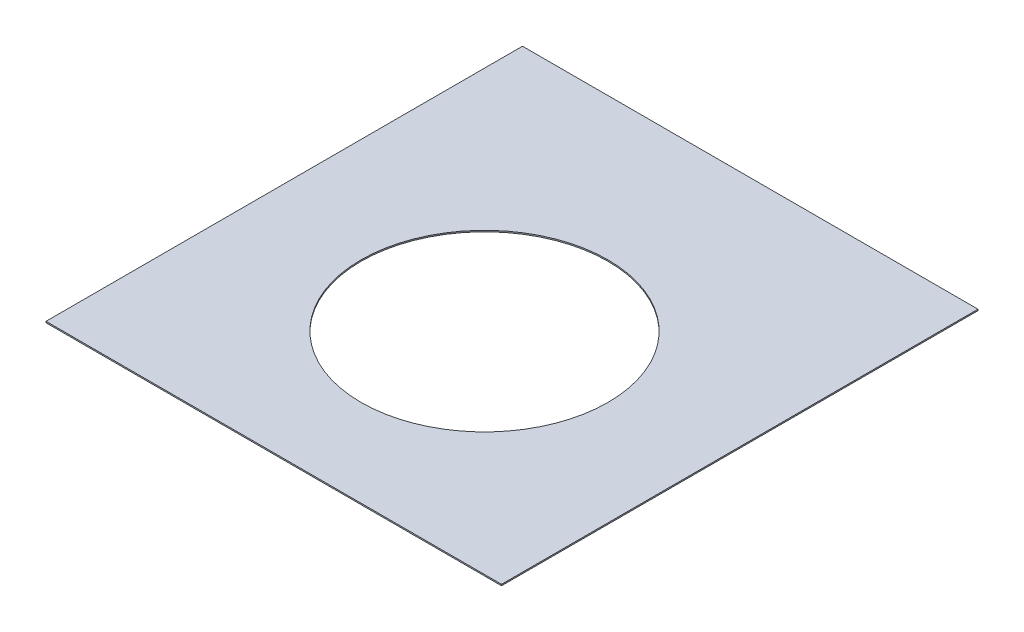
ISO-10303-21;
HEADER;
FILE_DESCRIPTION(('STEP AP214'),'2;1');
FILE_NAME('part.step','',(''),(''),'','','');
FILE_SCHEMA(('AUTOMOTIVE_DESIGN { 1 0 10303 214 1 1 1 1 }'));
ENDSEC;
DATA;
#1=APPLICATION_CONTEXT('core data for automotive mechanical design processes');
#2=APPLICATION_PROTOCOL_DEFINITION('international standard','automotive_design',2000,#1);
#3=PRODUCT_CONTEXT('',#1,'mechanical');
#4=PRODUCT('Part','Part','',(#3));
#5=PRODUCT_RELATED_PRODUCT_CATEGORY('part','',(#4));
#6=PRODUCT_DEFINITION_FORMATION('','',#4);
#7=PRODUCT_DEFINITION_CONTEXT('part definition',#1,'design');
#8=PRODUCT_DEFINITION('design','',#6,#7);
#9=PRODUCT_DEFINITION_SHAPE('','',#8);
#10=(LENGTH_UNIT() NAMED_UNIT(*) SI_UNIT(.MILLI.,.METRE.));
#11=(NAMED_UNIT(*) PLANE_ANGLE_UNIT() SI_UNIT($,.RADIAN.));
#12=(NAMED_UNIT(*) SI_UNIT($,.STERADIAN.) SOLID_ANGLE_UNIT());
#13=UNCERTAINTY_MEASURE_WITH_UNIT(LENGTH_MEASURE(1.E-05),#10,'distance_accuracy_value','');
#14=(GEOMETRIC_REPRESENTATION_CONTEXT(3) GLOBAL_UNCERTAINTY_ASSIGNED_CONTEXT((#13)) GLOBAL_UNIT_ASSIGNED_CONTEXT((#10,
#11,#12)) REPRESENTATION_CONTEXT('',''));
#15=CARTESIAN_POINT('',(0.,0.,0.));
#16=DIRECTION('',(0.,0.,1.));
#17=DIRECTION('',(1.,0.,0.));
#18=AXIS2_PLACEMENT_3D('',#15,#16,#17);
#19=CARTESIAN_POINT('',(828.675,-4.7625,-866.775));
#20=DIRECTION('',(1.,0.,0.));
#21=DIRECTION('',(0.,0.,-1.));
#22=AXIS2_PLACEMENT_3D('',#19,#20,#21);
#23=PLANE('',#22);
#24=DIRECTION('',(0.,0.,-1.));
#25=VECTOR('',#24,1.);
#26=CARTESIAN_POINT('',(828.675,0.,-866.775));
#27=LINE('',#26,#25);
#28=CARTESIAN_POINT('',(828.675,0.,866.775));
#29=VERTEX_POINT('',#28);
#30=CARTESIAN_POINT('',(828.675,0.,-866.775));
#31=VERTEX_POINT('',#30);
#32=EDGE_CURVE('E101',#29,#31,#27,.T.);
#33=ORIENTED_EDGE('',*,*,#32,.F.);
#34=DIRECTION('',(0.,1.,0.));
#35=VECTOR('',#34,1.);
#36=CARTESIAN_POINT('',(828.675,-4.7625,866.775));
#37=LINE('',#36,#35);
#38=CARTESIAN_POINT('',(828.675,-4.7625,866.775));
#39=VERTEX_POINT('',#38);
#40=EDGE_CURVE('E11',#39,#29,#37,.T.);
#41=ORIENTED_EDGE('',*,*,#40,.F.);
#42=DIRECTION('',(0.,0.,-1.));
#43=VECTOR('',#42,1.);
#44=CARTESIAN_POINT('',(828.675,-4.7625,-866.775));
#45=LINE('',#44,#43);
#46=CARTESIAN_POINT('',(828.675,-4.7625,-866.775));
#47=VERTEX_POINT('',#46);
#48=EDGE_CURVE('E94',#39,#47,#45,.T.);
#49=ORIENTED_EDGE('',*,*,#48,.T.);
#50=DIRECTION('',(0.,1.,0.));
#51=VECTOR('',#50,1.);
#52=CARTESIAN_POINT('',(828.675,-4.7625,-866.775));
#53=LINE('',#52,#51);
#54=EDGE_CURVE('E39',#47,#31,#53,.T.);
#55=ORIENTED_EDGE('',*,*,#54,.T.);
#56=EDGE_LOOP('',(#33,#41,#49,#55));
#57=FACE_BOUND('',#56,.T.);
#58=ADVANCED_FACE('F36',(#57),#23,.T.);
#59=CARTESIAN_POINT('',(-828.675,-4.7625,866.775));
#60=DIRECTION('',(0.,0.,1.));
#61=DIRECTION('',(1.,0.,0.));
#62=AXIS2_PLACEMENT_3D('',#59,#60,#61);
#63=PLANE('',#62);
#64=DIRECTION('',(1.,0.,0.));
#65=VECTOR('',#64,1.);
#66=CARTESIAN_POINT('',(-828.675,0.,866.775));
#67=LINE('',#66,#65);
#68=CARTESIAN_POINT('',(-828.675,0.,866.775));
#69=VERTEX_POINT('',#68);
#70=EDGE_CURVE('E96',#69,#29,#67,.T.);
#71=ORIENTED_EDGE('',*,*,#70,.F.);
#72=DIRECTION('',(0.,1.,0.));
#73=VECTOR('',#72,1.);
#74=CARTESIAN_POINT('',(-828.675,-4.7625,866.775));
#75=LINE('',#74,#73);
#76=CARTESIAN_POINT('',(-828.675,-4.7625,866.775));
#77=VERTEX_POINT('',#76);
#78=EDGE_CURVE('E45',#77,#69,#75,.T.);
#79=ORIENTED_EDGE('',*,*,#78,.F.);
#80=DIRECTION('',(1.,0.,0.));
#81=VECTOR('',#80,1.);
#82=CARTESIAN_POINT('',(-828.675,-4.7625,866.775));
#83=LINE('',#82,#81);
#84=EDGE_CURVE('E91',#77,#39,#83,.T.);
#85=ORIENTED_EDGE('',*,*,#84,.T.);
#86=ORIENTED_EDGE('',*,*,#40,.T.);
#87=EDGE_LOOP('',(#71,#79,#85,#86));
#88=FACE_BOUND('',#87,.T.);
#89=ADVANCED_FACE('F112',(#88),#63,.T.);
#90=CARTESIAN_POINT('',(-828.675,-4.7625,-866.775));
#91=DIRECTION('',(-1.,0.,0.));
#92=DIRECTION('',(0.,0.,1.));
#93=AXIS2_PLACEMENT_3D('',#90,#91,#92);
#94=PLANE('',#93);
#95=DIRECTION('',(0.,0.,1.));
#96=VECTOR('',#95,1.);
#97=CARTESIAN_POINT('',(-828.675,0.,-866.775));
#98=LINE('',#97,#96);
#99=CARTESIAN_POINT('',(-828.675,0.,-866.775));
#100=VERTEX_POINT('',#99);
#101=EDGE_CURVE('E86',#100,#69,#98,.T.);
#102=ORIENTED_EDGE('',*,*,#101,.F.);
#103=DIRECTION('',(0.,1.,0.));
#104=VECTOR('',#103,1.);
#105=CARTESIAN_POINT('',(-828.675,-4.7625,-866.775));
#106=LINE('',#105,#104);
#107=CARTESIAN_POINT('',(-828.675,-4.7625,-866.775));
#108=VERTEX_POINT('',#107);
#109=EDGE_CURVE('E81',#108,#100,#106,.T.);
#110=ORIENTED_EDGE('',*,*,#109,.F.);
#111=DIRECTION('',(0.,0.,1.));
#112=VECTOR('',#111,1.);
#113=CARTESIAN_POINT('',(-828.675,-4.7625,-866.775));
#114=LINE('',#113,#112);
#115=EDGE_CURVE('E84',#108,#77,#114,.T.);
#116=ORIENTED_EDGE('',*,*,#115,.T.);
#117=ORIENTED_EDGE('',*,*,#78,.T.);
#118=EDGE_LOOP('',(#102,#110,#116,#117));
#119=FACE_BOUND('',#118,.T.);
#120=ADVANCED_FACE('F83',(#119),#94,.T.);
#121=CARTESIAN_POINT('',(-828.675,-4.7625,-866.775));
#122=DIRECTION('',(0.,0.,-1.));
#123=DIRECTION('',(-1.,0.,0.));
#124=AXIS2_PLACEMENT_3D('',#121,#122,#123);
#125=PLANE('',#124);
#126=DIRECTION('',(-1.,0.,0.));
#127=VECTOR('',#126,1.);
#128=CARTESIAN_POINT('',(-828.675,0.,-866.775));
#129=LINE('',#128,#127);
#130=EDGE_CURVE('E104',#31,#100,#129,.T.);
#131=ORIENTED_EDGE('',*,*,#130,.F.);
#132=ORIENTED_EDGE('',*,*,#54,.F.);
#133=DIRECTION('',(-1.,0.,0.));
#134=VECTOR('',#133,1.);
#135=CARTESIAN_POINT('',(-828.675,-4.7625,-866.775));
#136=LINE('',#135,#134);
#137=EDGE_CURVE('E90',#47,#108,#136,.T.);
#138=ORIENTED_EDGE('',*,*,#137,.T.);
#139=ORIENTED_EDGE('',*,*,#109,.T.);
#140=EDGE_LOOP('',(#131,#132,#138,#139));
#141=FACE_BOUND('',#140,.T.);
#142=ADVANCED_FACE('F93',(#141),#125,.T.);
#143=CARTESIAN_POINT('',(828.675,-4.7625,866.775));
#144=DIRECTION('',(0.,1.,0.));
#145=DIRECTION('',(0.,0.,1.));
#146=AXIS2_PLACEMENT_3D('',#143,#144,#145);
#147=PLANE('',#146);
#148=CARTESIAN_POINT('',(-1.11022302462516E-13,-4.7625,100.0125));
#149=DIRECTION('',(0.,1.,0.));
#150=DIRECTION('',(0.,0.,1.));
#151=AXIS2_PLACEMENT_3D('',#148,#149,#150);
#152=CIRCLE('',#151,449.2625);
#153=CARTESIAN_POINT('',(-1.11022302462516E-13,-4.7625,549.275));
#154=VERTEX_POINT('',#153);
#155=EDGE_CURVE('E105',#154,#154,#152,.T.);
#156=ORIENTED_EDGE('',*,*,#155,.T.);
#157=EDGE_LOOP('',(#156));
#158=FACE_BOUND('',#157,.T.);
#159=ORIENTED_EDGE('',*,*,#48,.F.);
#160=ORIENTED_EDGE('',*,*,#84,.F.);
#161=ORIENTED_EDGE('',*,*,#115,.F.);
#162=ORIENTED_EDGE('',*,*,#137,.F.);
#163=EDGE_LOOP('',(#159,#160,#161,#162));
#164=FACE_BOUND('',#163,.T.);
#165=ADVANCED_FACE('F89',(#158,#164),#147,.F.);
#166=CARTESIAN_POINT('',(828.675,0.,866.775));
#167=DIRECTION('',(0.,1.,0.));
#168=DIRECTION('',(0.,0.,1.));
#169=AXIS2_PLACEMENT_3D('',#166,#167,#168);
#170=PLANE('',#169);
#171=CARTESIAN_POINT('',(-1.11022302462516E-13,0.,100.0125));
#172=DIRECTION('',(0.,1.,0.));
#173=DIRECTION('',(0.,0.,1.));
#174=AXIS2_PLACEMENT_3D('',#171,#172,#173);
#175=CIRCLE('',#174,449.2625);
#176=CARTESIAN_POINT('',(-1.11022302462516E-13,0.,549.275));
#177=VERTEX_POINT('',#176);
#178=EDGE_CURVE('E142',#177,#177,#175,.T.);
#179=ORIENTED_EDGE('',*,*,#178,.F.);
#180=EDGE_LOOP('',(#179));
#181=FACE_BOUND('',#180,.T.);
#182=ORIENTED_EDGE('',*,*,#32,.T.);
#183=ORIENTED_EDGE('',*,*,#130,.T.);
#184=ORIENTED_EDGE('',*,*,#101,.T.);
#185=ORIENTED_EDGE('',*,*,#70,.T.);
#186=EDGE_LOOP('',(#182,#183,#184,#185));
#187=FACE_BOUND('',#186,.T.);
#188=ADVANCED_FACE('F111',(#181,#187),#170,.T.);
#189=CARTESIAN_POINT('',(-1.11022302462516E-13,-4.7625,100.0125));
#190=DIRECTION('',(0.,1.,0.));
#191=DIRECTION('',(0.,0.,1.));
#192=AXIS2_PLACEMENT_3D('',#189,#190,#191);
#193=CYLINDRICAL_SURFACE('',#192,449.2625);
#194=CARTESIAN_POINT('',(-1.11022302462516E-13,-4.7625,549.275));
#195=CARTESIAN_POINT('',(-1.11022302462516E-13,-4.712890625,549.275));
#196=CARTESIAN_POINT('',(-1.11022302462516E-13,-4.66328125,549.275));
#197=CARTESIAN_POINT('',(-1.11022302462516E-13,-4.5640625,549.275));
#198=CARTESIAN_POINT('',(-1.11022302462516E-13,-4.514453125,549.275));
#199=CARTESIAN_POINT('',(-1.11022302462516E-13,-4.415234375,549.275));
#200=CARTESIAN_POINT('',(-1.11022302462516E-13,-4.365625,549.275));
#201=CARTESIAN_POINT('',(-1.11022302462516E-13,-4.26640625,549.275));
#202=CARTESIAN_POINT('',(-1.11022302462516E-13,-4.216796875,549.275));
#203=CARTESIAN_POINT('',(-1.11022302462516E-13,-4.117578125,549.275));
#204=CARTESIAN_POINT('',(-1.11022302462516E-13,-4.06796875,549.275));
#205=CARTESIAN_POINT('',(-1.11022302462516E-13,-3.96875,549.275));
#206=CARTESIAN_POINT('',(-1.11022302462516E-13,-3.919140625,549.275));
#207=CARTESIAN_POINT('',(-1.11022302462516E-13,-3.819921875,549.275));
#208=CARTESIAN_POINT('',(-1.11022302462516E-13,-3.7703125,549.275));
#209=CARTESIAN_POINT('',(-1.11022302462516E-13,-3.67109375,549.275));
#210=CARTESIAN_POINT('',(-1.11022302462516E-13,-3.621484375,549.275));
#211=CARTESIAN_POINT('',(-1.11022302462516E-13,-3.522265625,549.275));
#212=CARTESIAN_POINT('',(-1.11022302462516E-13,-3.47265625,549.275));
#213=CARTESIAN_POINT('',(-1.11022302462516E-13,-3.3734375,549.275));
#214=CARTESIAN_POINT('',(-1.11022302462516E-13,-3.323828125,549.275));
#215=CARTESIAN_POINT('',(-1.11022302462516E-13,-3.224609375,549.275));
#216=CARTESIAN_POINT('',(-1.11022302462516E-13,-3.175,549.275));
#217=CARTESIAN_POINT('',(-1.11022302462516E-13,-3.07578125,549.275));
#218=CARTESIAN_POINT('',(-1.11022302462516E-13,-3.026171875,549.275));
#219=CARTESIAN_POINT('',(-1.11022302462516E-13,-2.926953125,549.275));
#220=CARTESIAN_POINT('',(-1.11022302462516E-13,-2.87734375,549.275));
#221=CARTESIAN_POINT('',(-1.11022302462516E-13,-2.778125,549.275));
#222=CARTESIAN_POINT('',(-1.11022302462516E-13,-2.728515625,549.275));
#223=CARTESIAN_POINT('',(-1.11022302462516E-13,-2.629296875,549.275));
#224=CARTESIAN_POINT('',(-1.11022302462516E-13,-2.5796875,549.275));
#225=CARTESIAN_POINT('',(-1.11022302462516E-13,-2.48046875,549.275));
#226=CARTESIAN_POINT('',(-1.11022302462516E-13,-2.430859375,549.275));
#227=CARTESIAN_POINT('',(-1.11022302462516E-13,-2.331640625,549.275));
#228=CARTESIAN_POINT('',(-1.11022302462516E-13,-2.28203125,549.275));
#229=CARTESIAN_POINT('',(-1.11022302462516E-13,-2.1828125,549.275));
#230=CARTESIAN_POINT('',(-1.11022302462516E-13,-2.133203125,549.275));
#231=CARTESIAN_POINT('',(-1.11022302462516E-13,-2.033984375,549.275));
#232=CARTESIAN_POINT('',(-1.11022302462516E-13,-1.984375,549.275));
#233=CARTESIAN_POINT('',(-1.11022302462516E-13,-1.88515625,549.275));
#234=CARTESIAN_POINT('',(-1.11022302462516E-13,-1.835546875,549.275));
#235=CARTESIAN_POINT('',(-1.11022302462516E-13,-1.736328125,549.275));
#236=CARTESIAN_POINT('',(-1.11022302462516E-13,-1.68671875,549.275));
#237=CARTESIAN_POINT('',(-1.11022302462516E-13,-1.5875,549.275));
#238=CARTESIAN_POINT('',(-1.11022302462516E-13,-1.537890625,549.275));
#239=CARTESIAN_POINT('',(-1.11022302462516E-13,-1.438671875,549.275));
#240=CARTESIAN_POINT('',(-1.11022302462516E-13,-1.3890625,549.275));
#241=CARTESIAN_POINT('',(-1.11022302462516E-13,-1.28984375,549.275));
#242=CARTESIAN_POINT('',(-1.11022302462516E-13,-1.240234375,549.275));
#243=CARTESIAN_POINT('',(-1.11022302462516E-13,-1.141015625,549.275));
#244=CARTESIAN_POINT('',(-1.11022302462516E-13,-1.09140625,549.275));
#245=CARTESIAN_POINT('',(-1.11022302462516E-13,-0.9921875,549.275));
#246=CARTESIAN_POINT('',(-1.11022302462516E-13,-0.942578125,549.275));
#247=CARTESIAN_POINT('',(-1.11022302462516E-13,-0.843359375,549.275));
#248=CARTESIAN_POINT('',(-1.11022302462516E-13,-0.79375,549.275));
#249=CARTESIAN_POINT('',(-1.11022302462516E-13,-0.69453125,549.275));
#250=CARTESIAN_POINT('',(-1.11022302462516E-13,-0.644921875,549.275));
#251=CARTESIAN_POINT('',(-1.11022302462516E-13,-0.545703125,549.275));
#252=CARTESIAN_POINT('',(-1.11022302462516E-13,-0.49609375,549.275));
#253=CARTESIAN_POINT('',(-1.11022302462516E-13,-0.396875,549.275));
#254=CARTESIAN_POINT('',(-1.11022302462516E-13,-0.347265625,549.275));
#255=CARTESIAN_POINT('',(-1.11022302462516E-13,-0.248046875,549.275));
#256=CARTESIAN_POINT('',(-1.11022302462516E-13,-0.1984375,549.275));
#257=CARTESIAN_POINT('',(-1.11022302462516E-13,-0.09921875,549.275));
#258=CARTESIAN_POINT('',(-1.11022302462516E-13,-0.049609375,549.275));
#259=CARTESIAN_POINT('',(-1.11022302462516E-13,0.,549.275));
#260=B_SPLINE_CURVE_WITH_KNOTS('',3,(#194,#195,#196,#197,#198,#199,#200,#201,#202,#203,#204,
#205,#206,#207,#208,#209,#210,#211,#212,#213,#214,#215,#216,#217,#218,#219,#220,#221,#222,#223,
#224,#225,#226,#227,#228,#229,#230,#231,#232,#233,#234,#235,#236,#237,#238,#239,#240,#241,#242,
#243,#244,#245,#246,#247,#248,#249,#250,#251,#252,#253,#254,#255,#256,#257,#258,#259),
.UNSPECIFIED.,.F.,.F.,(4,2,2,2,2,2,2,2,2,2,2,2,2,2,2,2,2,2,2,2,2,2,2,2,2,2,2,2,2,2,2,2,4),(0.,
0.148828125,0.29765625,0.446484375,0.5953125,0.744140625,0.892968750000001,1.041796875,1.190625,
1.339453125,1.48828125,1.637109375,1.7859375,1.934765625,2.08359375,2.232421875,2.38125,
2.530078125,2.67890625,2.827734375,2.9765625,3.125390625,3.27421875,3.423046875,3.571875,
3.720703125,3.86953125,4.018359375,4.1671875,4.316015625,4.46484375,4.613671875,4.7625),.UNSPECIFIED.);
#261=EDGE_CURVE('BSEAM130',#154,#177,#260,.T.);
#262=ORIENTED_EDGE('',*,*,#155,.F.);
#263=ORIENTED_EDGE('',*,*,#178,.T.);
#264=ORIENTED_EDGE('',*,*,#261,.T.);
#265=ORIENTED_EDGE('',*,*,#261,.F.);
#266=EDGE_LOOP('',(#262,#264,#263,#265));
#267=FACE_BOUND('',#266,.T.);
#268=ADVANCED_FACE('F130',(#267),#193,.F.);
#269=CLOSED_SHELL('',(#58,#89,#120,#142,#165,#188,#268));
#270=MANIFOLD_SOLID_BREP('B2',#269);
#271=ADVANCED_BREP_SHAPE_REPRESENTATION('',(#18,#270),#14);
#272=SHAPE_DEFINITION_REPRESENTATION(#9,#271);
ENDSEC;
END-ISO-10303-21;
